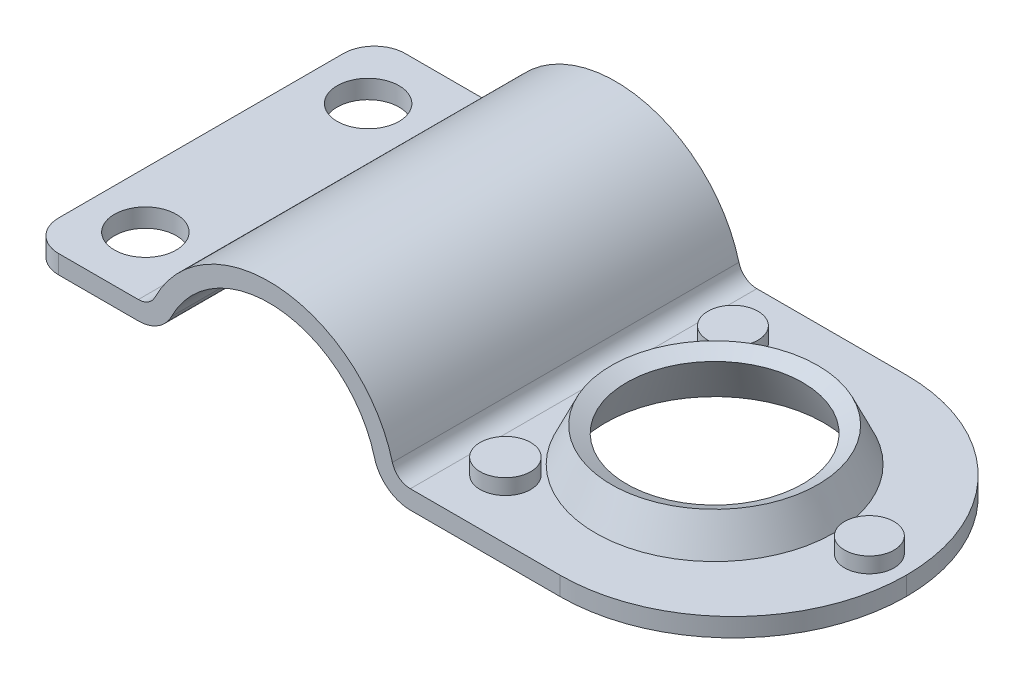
ISO-10303-21;
HEADER;
FILE_DESCRIPTION(('STEP AP214'),'2;1');
FILE_NAME('part.step','',(''),(''),'','','');
FILE_SCHEMA(('AUTOMOTIVE_DESIGN { 1 0 10303 214 1 1 1 1 }'));
ENDSEC;
DATA;
#1=APPLICATION_CONTEXT('core data for automotive mechanical design processes');
#2=APPLICATION_PROTOCOL_DEFINITION('international standard','automotive_design',2000,#1);
#3=PRODUCT_CONTEXT('',#1,'mechanical');
#4=PRODUCT('Part','Part','',(#3));
#5=PRODUCT_RELATED_PRODUCT_CATEGORY('part','',(#4));
#6=PRODUCT_DEFINITION_FORMATION('','',#4);
#7=PRODUCT_DEFINITION_CONTEXT('part definition',#1,'design');
#8=PRODUCT_DEFINITION('design','',#6,#7);
#9=PRODUCT_DEFINITION_SHAPE('','',#8);
#10=(LENGTH_UNIT() NAMED_UNIT(*) SI_UNIT(.MILLI.,.METRE.));
#11=(NAMED_UNIT(*) PLANE_ANGLE_UNIT() SI_UNIT($,.RADIAN.));
#12=(NAMED_UNIT(*) SI_UNIT($,.STERADIAN.) SOLID_ANGLE_UNIT());
#13=UNCERTAINTY_MEASURE_WITH_UNIT(LENGTH_MEASURE(1.E-05),#10,'distance_accuracy_value','');
#14=(GEOMETRIC_REPRESENTATION_CONTEXT(3) GLOBAL_UNCERTAINTY_ASSIGNED_CONTEXT((#13)) GLOBAL_UNIT_ASSIGNED_CONTEXT((#10,
#11,#12)) REPRESENTATION_CONTEXT('',''));
#15=CARTESIAN_POINT('',(0.,0.,0.));
#16=DIRECTION('',(0.,0.,1.));
#17=DIRECTION('',(1.,0.,0.));
#18=AXIS2_PLACEMENT_3D('',#15,#16,#17);
#19=CARTESIAN_POINT('',(22.8245481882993,2.99999999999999,1010.));
#20=DIRECTION('',(0.,-1.,0.));
#21=DIRECTION('',(1.,0.,0.));
#22=AXIS2_PLACEMENT_3D('',#19,#20,#21);
#23=PLANE('',#22);
#24=CARTESIAN_POINT('',(28.5730973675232,2.99999999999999,1019.61493336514));
#25=DIRECTION('',(0.,-1.,0.));
#26=DIRECTION('',(1.,0.,0.));
#27=AXIS2_PLACEMENT_3D('',#24,#25,#26);
#28=CIRCLE('',#27,4.05076971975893);
#29=CARTESIAN_POINT('',(32.6238670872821,2.99999999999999,1019.61493336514));
#30=VERTEX_POINT('',#29);
#31=EDGE_CURVE('E37',#30,#30,#28,.F.);
#32=ORIENTED_EDGE('',*,*,#31,.F.);
#33=EDGE_LOOP('',(#32));
#34=FACE_BOUND('',#33,.T.);
#35=CARTESIAN_POINT('',(44.,2.99999999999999,1038.));
#36=DIRECTION('',(0.,-1.,0.));
#37=DIRECTION('',(1.,0.,0.));
#38=AXIS2_PLACEMENT_3D('',#35,#36,#37);
#39=CIRCLE('',#38,19.25);
#40=CARTESIAN_POINT('',(63.25,2.99999999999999,1038.));
#41=VERTEX_POINT('',#40);
#42=EDGE_CURVE('E251',#41,#41,#39,.F.);
#43=ORIENTED_EDGE('',*,*,#42,.F.);
#44=EDGE_LOOP('',(#43));
#45=FACE_BOUND('',#44,.T.);
#46=DIRECTION('',(1.,0.,0.));
#47=VECTOR('',#46,1.);
#48=CARTESIAN_POINT('',(22.8245481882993,2.99999999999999,1066.));
#49=LINE('',#48,#47);
#50=CARTESIAN_POINT('',(22.8245481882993,2.99999999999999,1066.));
#51=VERTEX_POINT('',#50);
#52=CARTESIAN_POINT('',(47.,2.99999999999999,1066.));
#53=VERTEX_POINT('',#52);
#54=EDGE_CURVE('E178',#51,#53,#49,.T.);
#55=ORIENTED_EDGE('',*,*,#54,.T.);
#56=CARTESIAN_POINT('',(47.,2.99999999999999,1038.));
#57=DIRECTION('',(0.,-1.,0.));
#58=DIRECTION('',(1.,0.,0.));
#59=AXIS2_PLACEMENT_3D('',#56,#57,#58);
#60=CIRCLE('',#59,28.);
#61=CARTESIAN_POINT('',(75.,2.99999999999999,1038.));
#62=VERTEX_POINT('',#61);
#63=EDGE_CURVE('E49',#53,#62,#60,.F.);
#64=ORIENTED_EDGE('',*,*,#63,.T.);
#65=CARTESIAN_POINT('',(47.,2.99999999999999,1038.));
#66=DIRECTION('',(0.,-1.,0.));
#67=DIRECTION('',(1.,0.,0.));
#68=AXIS2_PLACEMENT_3D('',#65,#66,#67);
#69=CIRCLE('',#68,28.);
#70=CARTESIAN_POINT('',(47.,2.99999999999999,1010.));
#71=VERTEX_POINT('',#70);
#72=EDGE_CURVE('E44',#62,#71,#69,.F.);
#73=ORIENTED_EDGE('',*,*,#72,.T.);
#74=DIRECTION('',(1.,0.,0.));
#75=VECTOR('',#74,1.);
#76=CARTESIAN_POINT('',(22.8245481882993,2.99999999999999,1010.));
#77=LINE('',#76,#75);
#78=CARTESIAN_POINT('',(22.8245481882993,2.99999999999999,1010.));
#79=VERTEX_POINT('',#78);
#80=EDGE_CURVE('E198',#79,#71,#77,.T.);
#81=ORIENTED_EDGE('',*,*,#80,.F.);
#82=DIRECTION('',(0.,0.,1.));
#83=VECTOR('',#82,1.);
#84=CARTESIAN_POINT('',(22.8245481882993,2.99999999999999,1010.));
#85=LINE('',#84,#83);
#86=EDGE_CURVE('E200',#79,#51,#85,.T.);
#87=ORIENTED_EDGE('',*,*,#86,.T.);
#88=EDGE_LOOP('',(#55,#64,#73,#81,#87));
#89=FACE_BOUND('',#88,.T.);
#90=CARTESIAN_POINT('',(69.,2.99999999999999,1038.));
#91=DIRECTION('',(0.,-1.,0.));
#92=DIRECTION('',(1.,0.,0.));
#93=AXIS2_PLACEMENT_3D('',#90,#91,#92);
#94=CIRCLE('',#93,4.00000000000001);
#95=CARTESIAN_POINT('',(73.,2.99999999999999,1038.));
#96=VERTEX_POINT('',#95);
#97=EDGE_CURVE('E254',#96,#96,#94,.F.);
#98=ORIENTED_EDGE('',*,*,#97,.F.);
#99=EDGE_LOOP('',(#98));
#100=FACE_BOUND('',#99,.T.);
#101=CARTESIAN_POINT('',(28.5730973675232,2.99999999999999,1056.38506663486));
#102=DIRECTION('',(0.,-1.,0.));
#103=DIRECTION('',(1.,0.,0.));
#104=AXIS2_PLACEMENT_3D('',#101,#102,#103);
#105=CIRCLE('',#104,4.08946510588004);
#106=CARTESIAN_POINT('',(32.6625624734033,2.99999999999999,1056.38506663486));
#107=VERTEX_POINT('',#106);
#108=EDGE_CURVE('E11',#107,#107,#105,.F.);
#109=ORIENTED_EDGE('',*,*,#108,.F.);
#110=EDGE_LOOP('',(#109));
#111=FACE_BOUND('',#110,.T.);
#112=ADVANCED_FACE('F29',(#34,#45,#89,#100,#111),#23,.F.);
#113=CARTESIAN_POINT('',(22.8245481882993,0.,1010.));
#114=DIRECTION('',(0.,1.,0.));
#115=DIRECTION('',(0.,0.,1.));
#116=AXIS2_PLACEMENT_3D('',#113,#114,#115);
#117=PLANE('',#116);
#118=CARTESIAN_POINT('',(69.,0.,1038.));
#119=DIRECTION('',(0.,1.,0.));
#120=DIRECTION('',(-1.,0.,0.));
#121=AXIS2_PLACEMENT_3D('',#118,#119,#120);
#122=CIRCLE('',#121,3.00000000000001);
#123=CARTESIAN_POINT('',(66.,0.,1038.));
#124=VERTEX_POINT('',#123);
#125=EDGE_CURVE('E405',#124,#124,#122,.T.);
#126=ORIENTED_EDGE('',*,*,#125,.T.);
#127=EDGE_LOOP('',(#126));
#128=FACE_BOUND('',#127,.T.);
#129=CARTESIAN_POINT('',(28.5730973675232,0.,1019.61493336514));
#130=DIRECTION('',(0.,1.,0.));
#131=DIRECTION('',(1.,0.,0.));
#132=AXIS2_PLACEMENT_3D('',#129,#130,#131);
#133=CIRCLE('',#132,3.);
#134=CARTESIAN_POINT('',(25.5730973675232,0.,1019.61493336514));
#135=VERTEX_POINT('',#134);
#136=EDGE_CURVE('E409',#135,#135,#133,.T.);
#137=ORIENTED_EDGE('',*,*,#136,.T.);
#138=EDGE_LOOP('',(#137));
#139=FACE_BOUND('',#138,.T.);
#140=CARTESIAN_POINT('',(28.5730973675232,0.,1056.38506663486));
#141=DIRECTION('',(0.,1.,0.));
#142=DIRECTION('',(-1.,0.,0.));
#143=AXIS2_PLACEMENT_3D('',#140,#141,#142);
#144=CIRCLE('',#143,3.);
#145=CARTESIAN_POINT('',(25.5730973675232,0.,1056.38506663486));
#146=VERTEX_POINT('',#145);
#147=EDGE_CURVE('E413',#146,#146,#144,.T.);
#148=ORIENTED_EDGE('',*,*,#147,.T.);
#149=EDGE_LOOP('',(#148));
#150=FACE_BOUND('',#149,.T.);
#151=CARTESIAN_POINT('',(44.,0.,1038.));
#152=DIRECTION('',(0.,-1.,0.));
#153=DIRECTION('',(0.,0.,-1.));
#154=AXIS2_PLACEMENT_3D('',#151,#152,#153);
#155=CIRCLE('',#154,17.65);
#156=CARTESIAN_POINT('',(44.,0.,1020.35));
#157=VERTEX_POINT('',#156);
#158=EDGE_CURVE('E416',#157,#157,#155,.T.);
#159=ORIENTED_EDGE('',*,*,#158,.F.);
#160=EDGE_LOOP('',(#159));
#161=FACE_BOUND('',#160,.T.);
#162=CARTESIAN_POINT('',(47.,0.,1038.));
#163=DIRECTION('',(0.,1.,0.));
#164=DIRECTION('',(0.,0.,1.));
#165=AXIS2_PLACEMENT_3D('',#162,#163,#164);
#166=CIRCLE('',#165,28.);
#167=CARTESIAN_POINT('',(47.,0.,1010.));
#168=VERTEX_POINT('',#167);
#169=CARTESIAN_POINT('',(75.,0.,1038.));
#170=VERTEX_POINT('',#169);
#171=EDGE_CURVE('E242',#168,#170,#166,.F.);
#172=ORIENTED_EDGE('',*,*,#171,.T.);
#173=CARTESIAN_POINT('',(47.,0.,1038.));
#174=DIRECTION('',(0.,1.,0.));
#175=DIRECTION('',(0.,0.,1.));
#176=AXIS2_PLACEMENT_3D('',#173,#174,#175);
#177=CIRCLE('',#176,28.);
#178=CARTESIAN_POINT('',(47.,0.,1066.));
#179=VERTEX_POINT('',#178);
#180=EDGE_CURVE('E141',#170,#179,#177,.F.);
#181=ORIENTED_EDGE('',*,*,#180,.T.);
#182=DIRECTION('',(-1.,0.,0.));
#183=VECTOR('',#182,1.);
#184=CARTESIAN_POINT('',(22.8245481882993,0.,1066.));
#185=LINE('',#184,#183);
#186=CARTESIAN_POINT('',(22.8245481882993,0.,1066.));
#187=VERTEX_POINT('',#186);
#188=EDGE_CURVE('E135',#179,#187,#185,.T.);
#189=ORIENTED_EDGE('',*,*,#188,.T.);
#190=DIRECTION('',(0.,0.,1.));
#191=VECTOR('',#190,1.);
#192=CARTESIAN_POINT('',(22.8245481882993,0.,1010.));
#193=LINE('',#192,#191);
#194=CARTESIAN_POINT('',(22.8245481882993,0.,1010.));
#195=VERTEX_POINT('',#194);
#196=EDGE_CURVE('E138',#195,#187,#193,.T.);
#197=ORIENTED_EDGE('',*,*,#196,.F.);
#198=DIRECTION('',(-1.,0.,0.));
#199=VECTOR('',#198,1.);
#200=CARTESIAN_POINT('',(22.8245481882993,0.,1010.));
#201=LINE('',#200,#199);
#202=EDGE_CURVE('E180',#168,#195,#201,.T.);
#203=ORIENTED_EDGE('',*,*,#202,.F.);
#204=EDGE_LOOP('',(#172,#181,#189,#197,#203));
#205=FACE_BOUND('',#204,.T.);
#206=ADVANCED_FACE('F31',(#128,#139,#150,#161,#205),#117,.F.);
#207=CARTESIAN_POINT('',(22.8245481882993,6.,1010.));
#208=DIRECTION('',(0.,0.,1.));
#209=DIRECTION('',(1.,0.,0.));
#210=AXIS2_PLACEMENT_3D('',#207,#208,#209);
#211=CYLINDRICAL_SURFACE('',#210,6.);
#212=CARTESIAN_POINT('',(22.8245481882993,6.,1066.));
#213=DIRECTION('',(0.,0.,-1.));
#214=DIRECTION('',(-1.,0.,0.));
#215=AXIS2_PLACEMENT_3D('',#212,#213,#214);
#216=CIRCLE('',#215,6.);
#217=CARTESIAN_POINT('',(17.0216969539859,4.47457627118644,1066.));
#218=VERTEX_POINT('',#217);
#219=EDGE_CURVE('E146',#187,#218,#216,.T.);
#220=ORIENTED_EDGE('',*,*,#219,.T.);
#221=DIRECTION('',(0.,0.,1.));
#222=VECTOR('',#221,1.);
#223=CARTESIAN_POINT('',(17.0216969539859,4.47457627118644,1010.));
#224=LINE('',#223,#222);
#225=CARTESIAN_POINT('',(17.0216969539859,4.47457627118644,1010.));
#226=VERTEX_POINT('',#225);
#227=EDGE_CURVE('E155',#226,#218,#224,.T.);
#228=ORIENTED_EDGE('',*,*,#227,.F.);
#229=CARTESIAN_POINT('',(22.8245481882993,6.,1010.));
#230=DIRECTION('',(0.,0.,-1.));
#231=DIRECTION('',(-1.,0.,0.));
#232=AXIS2_PLACEMENT_3D('',#229,#230,#231);
#233=CIRCLE('',#232,6.);
#234=EDGE_CURVE('E153',#195,#226,#233,.T.);
#235=ORIENTED_EDGE('',*,*,#234,.F.);
#236=ORIENTED_EDGE('',*,*,#196,.T.);
#237=EDGE_LOOP('',(#220,#228,#235,#236));
#238=FACE_BOUND('',#237,.T.);
#239=ADVANCED_FACE('F150',(#238),#211,.T.);
#240=CARTESIAN_POINT('',(0.,0.,1010.));
#241=DIRECTION('',(0.,0.,1.));
#242=DIRECTION('',(1.,0.,0.));
#243=AXIS2_PLACEMENT_3D('',#240,#241,#242);
#244=CYLINDRICAL_SURFACE('',#243,17.6);
#245=CARTESIAN_POINT('',(0.,0.,1066.));
#246=DIRECTION('',(0.,0.,1.));
#247=DIRECTION('',(-1.,0.,0.));
#248=AXIS2_PLACEMENT_3D('',#245,#246,#247);
#249=CIRCLE('',#248,17.6);
#250=CARTESIAN_POINT('',(-15.762079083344,7.83050847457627,1066.));
#251=VERTEX_POINT('',#250);
#252=EDGE_CURVE('E160',#218,#251,#249,.T.);
#253=ORIENTED_EDGE('',*,*,#252,.T.);
#254=DIRECTION('',(0.,0.,1.));
#255=VECTOR('',#254,1.);
#256=CARTESIAN_POINT('',(-15.762079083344,7.83050847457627,1010.));
#257=LINE('',#256,#255);
#258=CARTESIAN_POINT('',(-15.762079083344,7.83050847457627,1010.));
#259=VERTEX_POINT('',#258);
#260=EDGE_CURVE('E221',#259,#251,#257,.T.);
#261=ORIENTED_EDGE('',*,*,#260,.F.);
#262=CARTESIAN_POINT('',(0.,0.,1010.));
#263=DIRECTION('',(0.,0.,1.));
#264=DIRECTION('',(-1.,0.,0.));
#265=AXIS2_PLACEMENT_3D('',#262,#263,#264);
#266=CIRCLE('',#265,17.6);
#267=EDGE_CURVE('E183',#226,#259,#266,.T.);
#268=ORIENTED_EDGE('',*,*,#267,.F.);
#269=ORIENTED_EDGE('',*,*,#227,.T.);
#270=EDGE_LOOP('',(#253,#261,#268,#269));
#271=FACE_BOUND('',#270,.T.);
#272=ADVANCED_FACE('F391',(#271),#244,.F.);
#273=CARTESIAN_POINT('',(-21.135515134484,10.5,1010.));
#274=DIRECTION('',(0.,0.,1.));
#275=DIRECTION('',(1.,0.,0.));
#276=AXIS2_PLACEMENT_3D('',#273,#274,#275);
#277=CYLINDRICAL_SURFACE('',#276,6.);
#278=CARTESIAN_POINT('',(-21.135515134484,10.5,1066.));
#279=DIRECTION('',(0.,0.,-1.));
#280=DIRECTION('',(-1.,0.,0.));
#281=AXIS2_PLACEMENT_3D('',#278,#279,#280);
#282=CIRCLE('',#281,6.);
#283=CARTESIAN_POINT('',(-21.135515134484,4.5,1066.));
#284=VERTEX_POINT('',#283);
#285=EDGE_CURVE('E162',#251,#284,#282,.T.);
#286=ORIENTED_EDGE('',*,*,#285,.T.);
#287=DIRECTION('',(0.,0.,1.));
#288=VECTOR('',#287,1.);
#289=CARTESIAN_POINT('',(-21.135515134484,4.5,1010.));
#290=LINE('',#289,#288);
#291=CARTESIAN_POINT('',(-21.135515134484,4.5,1010.));
#292=VERTEX_POINT('',#291);
#293=EDGE_CURVE('E218',#292,#284,#290,.T.);
#294=ORIENTED_EDGE('',*,*,#293,.F.);
#295=CARTESIAN_POINT('',(-21.135515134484,10.5,1010.));
#296=DIRECTION('',(0.,0.,-1.));
#297=DIRECTION('',(-1.,0.,0.));
#298=AXIS2_PLACEMENT_3D('',#295,#296,#297);
#299=CIRCLE('',#298,6.);
#300=EDGE_CURVE('E185',#259,#292,#299,.T.);
#301=ORIENTED_EDGE('',*,*,#300,.F.);
#302=ORIENTED_EDGE('',*,*,#260,.T.);
#303=EDGE_LOOP('',(#286,#294,#301,#302));
#304=FACE_BOUND('',#303,.T.);
#305=ADVANCED_FACE('F387',(#304),#277,.T.);
#306=CARTESIAN_POINT('',(-39.,4.5,1010.));
#307=DIRECTION('',(0.,1.,0.));
#308=DIRECTION('',(-1.,0.,0.));
#309=AXIS2_PLACEMENT_3D('',#306,#307,#308);
#310=PLANE('',#309);
#311=CARTESIAN_POINT('',(-30.,4.5,1020.));
#312=DIRECTION('',(0.,1.,0.));
#313=DIRECTION('',(-1.,0.,0.));
#314=AXIS2_PLACEMENT_3D('',#311,#312,#313);
#315=CIRCLE('',#314,5.00000000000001);
#316=CARTESIAN_POINT('',(-35.,4.5,1020.));
#317=VERTEX_POINT('',#316);
#318=EDGE_CURVE('E433',#317,#317,#315,.T.);
#319=ORIENTED_EDGE('',*,*,#318,.T.);
#320=EDGE_LOOP('',(#319));
#321=FACE_BOUND('',#320,.T.);
#322=CARTESIAN_POINT('',(-30.,4.5,1056.));
#323=DIRECTION('',(0.,1.,0.));
#324=DIRECTION('',(-1.,0.,0.));
#325=AXIS2_PLACEMENT_3D('',#322,#323,#324);
#326=CIRCLE('',#325,5.00000000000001);
#327=CARTESIAN_POINT('',(-35.,4.5,1056.));
#328=VERTEX_POINT('',#327);
#329=EDGE_CURVE('E427',#328,#328,#326,.T.);
#330=ORIENTED_EDGE('',*,*,#329,.T.);
#331=EDGE_LOOP('',(#330));
#332=FACE_BOUND('',#331,.T.);
#333=DIRECTION('',(-1.,0.,0.));
#334=VECTOR('',#333,1.);
#335=CARTESIAN_POINT('',(-39.,4.5,1066.));
#336=LINE('',#335,#334);
#337=CARTESIAN_POINT('',(-34.,4.5,1066.));
#338=VERTEX_POINT('',#337);
#339=EDGE_CURVE('E167',#284,#338,#336,.T.);
#340=ORIENTED_EDGE('',*,*,#339,.T.);
#341=CARTESIAN_POINT('',(-34.,4.5,1061.));
#342=DIRECTION('',(0.,1.,0.));
#343=DIRECTION('',(-1.,0.,0.));
#344=AXIS2_PLACEMENT_3D('',#341,#342,#343);
#345=CIRCLE('',#344,5.);
#346=CARTESIAN_POINT('',(-39.,4.5,1061.));
#347=VERTEX_POINT('',#346);
#348=EDGE_CURVE('E237',#338,#347,#345,.F.);
#349=ORIENTED_EDGE('',*,*,#348,.T.);
#350=DIRECTION('',(0.,0.,1.));
#351=VECTOR('',#350,1.);
#352=CARTESIAN_POINT('',(-39.,4.5,1010.));
#353=LINE('',#352,#351);
#354=CARTESIAN_POINT('',(-39.,4.5,1015.));
#355=VERTEX_POINT('',#354);
#356=EDGE_CURVE('E215',#355,#347,#353,.T.);
#357=ORIENTED_EDGE('',*,*,#356,.F.);
#358=CARTESIAN_POINT('',(-34.,4.5,1015.));
#359=DIRECTION('',(0.,1.,0.));
#360=DIRECTION('',(-1.,0.,0.));
#361=AXIS2_PLACEMENT_3D('',#358,#359,#360);
#362=CIRCLE('',#361,5.);
#363=CARTESIAN_POINT('',(-34.,4.5,1010.));
#364=VERTEX_POINT('',#363);
#365=EDGE_CURVE('E235',#355,#364,#362,.F.);
#366=ORIENTED_EDGE('',*,*,#365,.T.);
#367=DIRECTION('',(-1.,0.,0.));
#368=VECTOR('',#367,1.);
#369=CARTESIAN_POINT('',(-39.,4.5,1010.));
#370=LINE('',#369,#368);
#371=EDGE_CURVE('E187',#292,#364,#370,.T.);
#372=ORIENTED_EDGE('',*,*,#371,.F.);
#373=ORIENTED_EDGE('',*,*,#293,.T.);
#374=EDGE_LOOP('',(#340,#349,#357,#366,#372,#373));
#375=FACE_BOUND('',#374,.T.);
#376=ADVANCED_FACE('F383',(#321,#332,#375),#310,.F.);
#377=CARTESIAN_POINT('',(-39.,7.5,1010.));
#378=DIRECTION('',(1.,0.,0.));
#379=DIRECTION('',(0.,0.,-1.));
#380=AXIS2_PLACEMENT_3D('',#377,#378,#379);
#381=PLANE('',#380);
#382=ORIENTED_EDGE('',*,*,#356,.T.);
#383=DIRECTION('',(0.,1.,0.));
#384=VECTOR('',#383,1.);
#385=CARTESIAN_POINT('',(-39.,7.5,1061.));
#386=LINE('',#385,#384);
#387=CARTESIAN_POINT('',(-39.,7.5,1061.));
#388=VERTEX_POINT('',#387);
#389=EDGE_CURVE('E226',#347,#388,#386,.T.);
#390=ORIENTED_EDGE('',*,*,#389,.T.);
#391=DIRECTION('',(0.,0.,1.));
#392=VECTOR('',#391,1.);
#393=CARTESIAN_POINT('',(-39.,7.5,1010.));
#394=LINE('',#393,#392);
#395=CARTESIAN_POINT('',(-39.,7.5,1015.));
#396=VERTEX_POINT('',#395);
#397=EDGE_CURVE('E212',#396,#388,#394,.T.);
#398=ORIENTED_EDGE('',*,*,#397,.F.);
#399=DIRECTION('',(0.,1.,0.));
#400=VECTOR('',#399,1.);
#401=CARTESIAN_POINT('',(-39.,4.5,1015.));
#402=LINE('',#401,#400);
#403=EDGE_CURVE('E154',#396,#355,#402,.F.);
#404=ORIENTED_EDGE('',*,*,#403,.T.);
#405=EDGE_LOOP('',(#382,#390,#398,#404));
#406=FACE_BOUND('',#405,.T.);
#407=ADVANCED_FACE('F379',(#406),#381,.F.);
#408=CARTESIAN_POINT('',(-39.,7.5,1010.));
#409=DIRECTION('',(0.,-1.,0.));
#410=DIRECTION('',(1.,0.,0.));
#411=AXIS2_PLACEMENT_3D('',#408,#409,#410);
#412=PLANE('',#411);
#413=CARTESIAN_POINT('',(-30.,7.5,1020.));
#414=DIRECTION('',(0.,1.,0.));
#415=DIRECTION('',(1.,0.,0.));
#416=AXIS2_PLACEMENT_3D('',#413,#414,#415);
#417=CIRCLE('',#416,5.00000000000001);
#418=CARTESIAN_POINT('',(-25.,7.5,1020.));
#419=VERTEX_POINT('',#418);
#420=EDGE_CURVE('E436',#419,#419,#417,.T.);
#421=ORIENTED_EDGE('',*,*,#420,.F.);
#422=EDGE_LOOP('',(#421));
#423=FACE_BOUND('',#422,.T.);
#424=CARTESIAN_POINT('',(-30.,7.5,1056.));
#425=DIRECTION('',(0.,1.,0.));
#426=DIRECTION('',(-1.,0.,0.));
#427=AXIS2_PLACEMENT_3D('',#424,#425,#426);
#428=CIRCLE('',#427,5.00000000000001);
#429=CARTESIAN_POINT('',(-35.,7.5,1056.));
#430=VERTEX_POINT('',#429);
#431=EDGE_CURVE('E430',#430,#430,#428,.T.);
#432=ORIENTED_EDGE('',*,*,#431,.F.);
#433=EDGE_LOOP('',(#432));
#434=FACE_BOUND('',#433,.T.);
#435=ORIENTED_EDGE('',*,*,#397,.T.);
#436=CARTESIAN_POINT('',(-34.,7.5,1061.));
#437=DIRECTION('',(0.,-1.,0.));
#438=DIRECTION('',(1.,0.,0.));
#439=AXIS2_PLACEMENT_3D('',#436,#437,#438);
#440=CIRCLE('',#439,5.);
#441=CARTESIAN_POINT('',(-34.,7.5,1066.));
#442=VERTEX_POINT('',#441);
#443=EDGE_CURVE('E231',#388,#442,#440,.F.);
#444=ORIENTED_EDGE('',*,*,#443,.T.);
#445=DIRECTION('',(1.,0.,0.));
#446=VECTOR('',#445,1.);
#447=CARTESIAN_POINT('',(-39.,7.5,1066.));
#448=LINE('',#447,#446);
#449=CARTESIAN_POINT('',(-21.135515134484,7.5,1066.));
#450=VERTEX_POINT('',#449);
#451=EDGE_CURVE('E170',#442,#450,#448,.T.);
#452=ORIENTED_EDGE('',*,*,#451,.T.);
#453=DIRECTION('',(0.,0.,1.));
#454=VECTOR('',#453,1.);
#455=CARTESIAN_POINT('',(-21.135515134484,7.5,1010.));
#456=LINE('',#455,#454);
#457=CARTESIAN_POINT('',(-21.135515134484,7.5,1010.));
#458=VERTEX_POINT('',#457);
#459=EDGE_CURVE('E209',#458,#450,#456,.T.);
#460=ORIENTED_EDGE('',*,*,#459,.F.);
#461=DIRECTION('',(1.,0.,0.));
#462=VECTOR('',#461,1.);
#463=CARTESIAN_POINT('',(-39.,7.5,1010.));
#464=LINE('',#463,#462);
#465=CARTESIAN_POINT('',(-34.,7.5,1010.));
#466=VERTEX_POINT('',#465);
#467=EDGE_CURVE('E190',#466,#458,#464,.T.);
#468=ORIENTED_EDGE('',*,*,#467,.F.);
#469=CARTESIAN_POINT('',(-34.,7.5,1015.));
#470=DIRECTION('',(0.,-1.,0.));
#471=DIRECTION('',(1.,0.,0.));
#472=AXIS2_PLACEMENT_3D('',#469,#470,#471);
#473=CIRCLE('',#472,5.);
#474=EDGE_CURVE('E229',#466,#396,#473,.F.);
#475=ORIENTED_EDGE('',*,*,#474,.T.);
#476=EDGE_LOOP('',(#435,#444,#452,#460,#468,#475));
#477=FACE_BOUND('',#476,.T.);
#478=ADVANCED_FACE('F375',(#423,#434,#477),#412,.F.);
#479=CARTESIAN_POINT('',(-21.135515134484,10.5,1010.));
#480=DIRECTION('',(0.,0.,1.));
#481=DIRECTION('',(1.,0.,0.));
#482=AXIS2_PLACEMENT_3D('',#479,#480,#481);
#483=CYLINDRICAL_SURFACE('',#482,3.);
#484=CARTESIAN_POINT('',(-21.135515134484,10.5,1066.));
#485=DIRECTION('',(0.,0.,1.));
#486=DIRECTION('',(-1.,0.,0.));
#487=AXIS2_PLACEMENT_3D('',#484,#485,#486);
#488=CIRCLE('',#487,3.);
#489=CARTESIAN_POINT('',(-18.448797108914,9.16525423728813,1066.));
#490=VERTEX_POINT('',#489);
#491=EDGE_CURVE('E172',#450,#490,#488,.T.);
#492=ORIENTED_EDGE('',*,*,#491,.T.);
#493=DIRECTION('',(0.,0.,1.));
#494=VECTOR('',#493,1.);
#495=CARTESIAN_POINT('',(-18.448797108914,9.16525423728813,1010.));
#496=LINE('',#495,#494);
#497=CARTESIAN_POINT('',(-18.448797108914,9.16525423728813,1010.));
#498=VERTEX_POINT('',#497);
#499=EDGE_CURVE('E206',#498,#490,#496,.T.);
#500=ORIENTED_EDGE('',*,*,#499,.F.);
#501=CARTESIAN_POINT('',(-21.135515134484,10.5,1010.));
#502=DIRECTION('',(0.,0.,1.));
#503=DIRECTION('',(-1.,0.,0.));
#504=AXIS2_PLACEMENT_3D('',#501,#502,#503);
#505=CIRCLE('',#504,3.);
#506=EDGE_CURVE('E192',#458,#498,#505,.T.);
#507=ORIENTED_EDGE('',*,*,#506,.F.);
#508=ORIENTED_EDGE('',*,*,#459,.T.);
#509=EDGE_LOOP('',(#492,#500,#507,#508));
#510=FACE_BOUND('',#509,.T.);
#511=ADVANCED_FACE('F371',(#510),#483,.F.);
#512=CARTESIAN_POINT('',(0.,0.,1010.));
#513=DIRECTION('',(0.,0.,1.));
#514=DIRECTION('',(1.,0.,0.));
#515=AXIS2_PLACEMENT_3D('',#512,#513,#514);
#516=CYLINDRICAL_SURFACE('',#515,20.6);
#517=CARTESIAN_POINT('',(0.,0.,1066.));
#518=DIRECTION('',(0.,0.,-1.));
#519=DIRECTION('',(-1.,0.,0.));
#520=AXIS2_PLACEMENT_3D('',#517,#518,#519);
#521=CIRCLE('',#520,20.6);
#522=CARTESIAN_POINT('',(19.9231225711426,5.23728813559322,1066.));
#523=VERTEX_POINT('',#522);
#524=EDGE_CURVE('E174',#490,#523,#521,.T.);
#525=ORIENTED_EDGE('',*,*,#524,.T.);
#526=DIRECTION('',(0.,0.,1.));
#527=VECTOR('',#526,1.);
#528=CARTESIAN_POINT('',(19.9231225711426,5.23728813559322,1010.));
#529=LINE('',#528,#527);
#530=CARTESIAN_POINT('',(19.9231225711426,5.23728813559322,1010.));
#531=VERTEX_POINT('',#530);
#532=EDGE_CURVE('E203',#531,#523,#529,.T.);
#533=ORIENTED_EDGE('',*,*,#532,.F.);
#534=CARTESIAN_POINT('',(0.,0.,1010.));
#535=DIRECTION('',(0.,0.,-1.));
#536=DIRECTION('',(-1.,0.,0.));
#537=AXIS2_PLACEMENT_3D('',#534,#535,#536);
#538=CIRCLE('',#537,20.6);
#539=EDGE_CURVE('E194',#498,#531,#538,.T.);
#540=ORIENTED_EDGE('',*,*,#539,.F.);
#541=ORIENTED_EDGE('',*,*,#499,.T.);
#542=EDGE_LOOP('',(#525,#533,#540,#541));
#543=FACE_BOUND('',#542,.T.);
#544=ADVANCED_FACE('F367',(#543),#516,.T.);
#545=CARTESIAN_POINT('',(22.8245481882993,5.99999999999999,1010.));
#546=DIRECTION('',(0.,0.,1.));
#547=DIRECTION('',(1.,0.,0.));
#548=AXIS2_PLACEMENT_3D('',#545,#546,#547);
#549=CYLINDRICAL_SURFACE('',#548,3.);
#550=CARTESIAN_POINT('',(22.8245481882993,5.99999999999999,1066.));
#551=DIRECTION('',(0.,0.,1.));
#552=DIRECTION('',(-1.,0.,0.));
#553=AXIS2_PLACEMENT_3D('',#550,#551,#552);
#554=CIRCLE('',#553,3.);
#555=EDGE_CURVE('E176',#523,#51,#554,.T.);
#556=ORIENTED_EDGE('',*,*,#555,.T.);
#557=ORIENTED_EDGE('',*,*,#86,.F.);
#558=CARTESIAN_POINT('',(22.8245481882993,5.99999999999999,1010.));
#559=DIRECTION('',(0.,0.,1.));
#560=DIRECTION('',(-1.,0.,0.));
#561=AXIS2_PLACEMENT_3D('',#558,#559,#560);
#562=CIRCLE('',#561,3.);
#563=EDGE_CURVE('E196',#531,#79,#562,.T.);
#564=ORIENTED_EDGE('',*,*,#563,.F.);
#565=ORIENTED_EDGE('',*,*,#532,.T.);
#566=EDGE_LOOP('',(#556,#557,#564,#565));
#567=FACE_BOUND('',#566,.T.);
#568=ADVANCED_FACE('F362',(#567),#549,.F.);
#569=CARTESIAN_POINT('',(22.8245481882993,6.,1010.));
#570=DIRECTION('',(0.,0.,-1.));
#571=DIRECTION('',(-1.,0.,0.));
#572=AXIS2_PLACEMENT_3D('',#569,#570,#571);
#573=PLANE('',#572);
#574=ORIENTED_EDGE('',*,*,#80,.T.);
#575=DIRECTION('',(0.,-1.,0.));
#576=VECTOR('',#575,1.);
#577=CARTESIAN_POINT('',(47.,0.,1010.));
#578=LINE('',#577,#576);
#579=EDGE_CURVE('E249',#71,#168,#578,.T.);
#580=ORIENTED_EDGE('',*,*,#579,.T.);
#581=ORIENTED_EDGE('',*,*,#202,.T.);
#582=ORIENTED_EDGE('',*,*,#234,.T.);
#583=ORIENTED_EDGE('',*,*,#267,.T.);
#584=ORIENTED_EDGE('',*,*,#300,.T.);
#585=ORIENTED_EDGE('',*,*,#371,.T.);
#586=DIRECTION('',(0.,1.,0.));
#587=VECTOR('',#586,1.);
#588=CARTESIAN_POINT('',(-34.,7.5,1010.));
#589=LINE('',#588,#587);
#590=EDGE_CURVE('E239',#364,#466,#589,.T.);
#591=ORIENTED_EDGE('',*,*,#590,.T.);
#592=ORIENTED_EDGE('',*,*,#467,.T.);
#593=ORIENTED_EDGE('',*,*,#506,.T.);
#594=ORIENTED_EDGE('',*,*,#539,.T.);
#595=ORIENTED_EDGE('',*,*,#563,.T.);
#596=EDGE_LOOP('',(#574,#580,#581,#582,#583,#584,#585,#591,#592,#593,#594,#595));
#597=FACE_BOUND('',#596,.T.);
#598=ADVANCED_FACE('F360',(#597),#573,.T.);
#599=CARTESIAN_POINT('',(22.8245481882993,6.,1066.));
#600=DIRECTION('',(0.,0.,-1.));
#601=DIRECTION('',(-1.,0.,0.));
#602=AXIS2_PLACEMENT_3D('',#599,#600,#601);
#603=PLANE('',#602);
#604=ORIENTED_EDGE('',*,*,#188,.F.);
#605=DIRECTION('',(0.,-1.,0.));
#606=VECTOR('',#605,1.);
#607=CARTESIAN_POINT('',(47.,6.,1066.));
#608=LINE('',#607,#606);
#609=EDGE_CURVE('E245',#179,#53,#608,.F.);
#610=ORIENTED_EDGE('',*,*,#609,.T.);
#611=ORIENTED_EDGE('',*,*,#54,.F.);
#612=ORIENTED_EDGE('',*,*,#555,.F.);
#613=ORIENTED_EDGE('',*,*,#524,.F.);
#614=ORIENTED_EDGE('',*,*,#491,.F.);
#615=ORIENTED_EDGE('',*,*,#451,.F.);
#616=DIRECTION('',(0.,1.,0.));
#617=VECTOR('',#616,1.);
#618=CARTESIAN_POINT('',(-34.,6.,1066.));
#619=LINE('',#618,#617);
#620=EDGE_CURVE('E233',#442,#338,#619,.F.);
#621=ORIENTED_EDGE('',*,*,#620,.T.);
#622=ORIENTED_EDGE('',*,*,#339,.F.);
#623=ORIENTED_EDGE('',*,*,#285,.F.);
#624=ORIENTED_EDGE('',*,*,#252,.F.);
#625=ORIENTED_EDGE('',*,*,#219,.F.);
#626=EDGE_LOOP('',(#604,#610,#611,#612,#613,#614,#615,#621,#622,#623,#624,#625));
#627=FACE_BOUND('',#626,.T.);
#628=ADVANCED_FACE('F158',(#627),#603,.F.);
#629=CARTESIAN_POINT('',(-34.,7.5,1061.));
#630=DIRECTION('',(0.,1.,0.));
#631=DIRECTION('',(0.,0.,1.));
#632=AXIS2_PLACEMENT_3D('',#629,#630,#631);
#633=CYLINDRICAL_SURFACE('',#632,5.);
#634=ORIENTED_EDGE('',*,*,#348,.F.);
#635=ORIENTED_EDGE('',*,*,#620,.F.);
#636=ORIENTED_EDGE('',*,*,#443,.F.);
#637=ORIENTED_EDGE('',*,*,#389,.F.);
#638=EDGE_LOOP('',(#634,#635,#636,#637));
#639=FACE_BOUND('',#638,.T.);
#640=ADVANCED_FACE('F353',(#639),#633,.T.);
#641=CARTESIAN_POINT('',(-34.,6.,1015.));
#642=DIRECTION('',(0.,-1.,0.));
#643=DIRECTION('',(0.,0.,-1.));
#644=AXIS2_PLACEMENT_3D('',#641,#642,#643);
#645=CYLINDRICAL_SURFACE('',#644,5.);
#646=ORIENTED_EDGE('',*,*,#365,.F.);
#647=ORIENTED_EDGE('',*,*,#403,.F.);
#648=ORIENTED_EDGE('',*,*,#474,.F.);
#649=ORIENTED_EDGE('',*,*,#590,.F.);
#650=EDGE_LOOP('',(#646,#647,#648,#649));
#651=FACE_BOUND('',#650,.T.);
#652=ADVANCED_FACE('F349',(#651),#645,.T.);
#653=CARTESIAN_POINT('',(47.,6.,1038.));
#654=DIRECTION('',(0.,1.,0.));
#655=DIRECTION('',(0.,0.,1.));
#656=AXIS2_PLACEMENT_3D('',#653,#654,#655);
#657=CYLINDRICAL_SURFACE('',#656,28.);
#658=ORIENTED_EDGE('',*,*,#579,.F.);
#659=ORIENTED_EDGE('',*,*,#72,.F.);
#660=DIRECTION('',(0.,-1.,0.));
#661=VECTOR('',#660,1.);
#662=CARTESIAN_POINT('',(75.,2.99999999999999,1038.));
#663=LINE('',#662,#661);
#664=EDGE_CURVE('E147',#170,#62,#663,.F.);
#665=ORIENTED_EDGE('',*,*,#664,.F.);
#666=ORIENTED_EDGE('',*,*,#171,.F.);
#667=EDGE_LOOP('',(#658,#659,#665,#666));
#668=FACE_BOUND('',#667,.T.);
#669=ADVANCED_FACE('F345',(#668),#657,.T.);
#670=CARTESIAN_POINT('',(47.,2.99999999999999,1038.));
#671=DIRECTION('',(0.,-1.,0.));
#672=DIRECTION('',(0.,0.,-1.));
#673=AXIS2_PLACEMENT_3D('',#670,#671,#672);
#674=CYLINDRICAL_SURFACE('',#673,28.);
#675=ORIENTED_EDGE('',*,*,#63,.F.);
#676=ORIENTED_EDGE('',*,*,#609,.F.);
#677=ORIENTED_EDGE('',*,*,#180,.F.);
#678=ORIENTED_EDGE('',*,*,#664,.T.);
#679=EDGE_LOOP('',(#675,#676,#677,#678));
#680=FACE_BOUND('',#679,.T.);
#681=ADVANCED_FACE('F341',(#680),#674,.T.);
#682=CARTESIAN_POINT('',(44.,2.99999999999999,1038.));
#683=DIRECTION('',(0.,-1.,0.));
#684=DIRECTION('',(-1.,0.,0.));
#685=AXIS2_PLACEMENT_3D('',#682,#683,#684);
#686=CONICAL_SURFACE('',#685,19.25,0.436332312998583);
#687=CARTESIAN_POINT('',(44.,8.49999999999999,1038.));
#688=DIRECTION('',(0.,-1.,0.));
#689=DIRECTION('',(0.,0.,-1.));
#690=AXIS2_PLACEMENT_3D('',#687,#688,#689);
#691=CIRCLE('',#690,16.6853078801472);
#692=CARTESIAN_POINT('',(44.,8.49999999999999,1021.31469211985));
#693=VERTEX_POINT('',#692);
#694=EDGE_CURVE('E422',#693,#693,#691,.T.);
#695=ORIENTED_EDGE('',*,*,#694,.T.);
#696=EDGE_LOOP('',(#695));
#697=FACE_BOUND('',#696,.T.);
#698=ORIENTED_EDGE('',*,*,#42,.T.);
#699=EDGE_LOOP('',(#698));
#700=FACE_BOUND('',#699,.T.);
#701=ADVANCED_FACE('F337',(#697,#700),#686,.T.);
#702=CARTESIAN_POINT('',(44.,0.,1038.));
#703=DIRECTION('',(0.,-1.,0.));
#704=DIRECTION('',(0.,0.,-1.));
#705=AXIS2_PLACEMENT_3D('',#702,#703,#704);
#706=CONICAL_SURFACE('',#705,17.65,0.436332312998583);
#707=CARTESIAN_POINT('',(44.,7.35134586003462,1038.));
#708=DIRECTION('',(0.,-1.,0.));
#709=DIRECTION('',(0.,0.,-1.));
#710=AXIS2_PLACEMENT_3D('',#707,#708,#709);
#711=CIRCLE('',#710,14.2220111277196);
#712=CARTESIAN_POINT('',(44.,7.35134586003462,1023.77798887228));
#713=VERTEX_POINT('',#712);
#714=EDGE_CURVE('E418',#713,#713,#711,.T.);
#715=ORIENTED_EDGE('',*,*,#714,.F.);
#716=EDGE_LOOP('',(#715));
#717=FACE_BOUND('',#716,.T.);
#718=ORIENTED_EDGE('',*,*,#158,.T.);
#719=EDGE_LOOP('',(#718));
#720=FACE_BOUND('',#719,.T.);
#721=ADVANCED_FACE('F333',(#717,#720),#706,.F.);
#722=CARTESIAN_POINT('',(44.,7.35134586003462,1038.));
#723=DIRECTION('',(0.,1.,0.));
#724=DIRECTION('',(0.,0.,1.));
#725=AXIS2_PLACEMENT_3D('',#722,#723,#724);
#726=CONICAL_SURFACE('',#725,14.2220111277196,1.1344640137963);
#727=ORIENTED_EDGE('',*,*,#694,.F.);
#728=EDGE_LOOP('',(#727));
#729=FACE_BOUND('',#728,.T.);
#730=ORIENTED_EDGE('',*,*,#714,.T.);
#731=EDGE_LOOP('',(#730));
#732=FACE_BOUND('',#731,.T.);
#733=ADVANCED_FACE('F329',(#729,#732),#726,.F.);
#734=CARTESIAN_POINT('',(-30.,0.,1056.));
#735=DIRECTION('',(0.,1.,0.));
#736=DIRECTION('',(-1.,0.,0.));
#737=AXIS2_PLACEMENT_3D('',#734,#735,#736);
#738=CYLINDRICAL_SURFACE('',#737,5.00000000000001);
#739=ORIENTED_EDGE('',*,*,#431,.T.);
#740=EDGE_LOOP('',(#739));
#741=FACE_BOUND('',#740,.T.);
#742=ORIENTED_EDGE('',*,*,#329,.F.);
#743=EDGE_LOOP('',(#742));
#744=FACE_BOUND('',#743,.T.);
#745=ADVANCED_FACE('F325',(#741,#744),#738,.F.);
#746=CARTESIAN_POINT('',(-30.,0.,1020.));
#747=DIRECTION('',(0.,1.,0.));
#748=DIRECTION('',(-1.,0.,0.));
#749=AXIS2_PLACEMENT_3D('',#746,#747,#748);
#750=CYLINDRICAL_SURFACE('',#749,5.00000000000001);
#751=ORIENTED_EDGE('',*,*,#420,.T.);
#752=EDGE_LOOP('',(#751));
#753=FACE_BOUND('',#752,.T.);
#754=ORIENTED_EDGE('',*,*,#318,.F.);
#755=EDGE_LOOP('',(#754));
#756=FACE_BOUND('',#755,.T.);
#757=ADVANCED_FACE('F321',(#753,#756),#750,.F.);
#758=CARTESIAN_POINT('',(28.5730973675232,0.,1056.38506663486));
#759=DIRECTION('',(0.,1.,0.));
#760=DIRECTION('',(-1.,0.,0.));
#761=AXIS2_PLACEMENT_3D('',#758,#759,#760);
#762=CYLINDRICAL_SURFACE('',#761,3.);
#763=CARTESIAN_POINT('',(28.5730973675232,2.99999999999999,1056.38506663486));
#764=DIRECTION('',(0.,1.,0.));
#765=DIRECTION('',(-1.,0.,0.));
#766=AXIS2_PLACEMENT_3D('',#763,#764,#765);
#767=CIRCLE('',#766,3.);
#768=CARTESIAN_POINT('',(25.5730973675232,2.99999999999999,1056.38506663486));
#769=VERTEX_POINT('',#768);
#770=EDGE_CURVE('E454',#769,#769,#767,.F.);
#771=CARTESIAN_POINT('',(25.5730973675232,0.,1056.38506663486));
#772=CARTESIAN_POINT('',(25.5730973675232,0.0312499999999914,1056.38506663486));
#773=CARTESIAN_POINT('',(25.5730973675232,0.0624999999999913,1056.38506663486));
#774=CARTESIAN_POINT('',(25.5730973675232,0.124999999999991,1056.38506663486));
#775=CARTESIAN_POINT('',(25.5730973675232,0.156249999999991,1056.38506663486));
#776=CARTESIAN_POINT('',(25.5730973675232,0.218749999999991,1056.38506663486));
#777=CARTESIAN_POINT('',(25.5730973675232,0.249999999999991,1056.38506663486));
#778=CARTESIAN_POINT('',(25.5730973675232,0.312499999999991,1056.38506663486));
#779=CARTESIAN_POINT('',(25.5730973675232,0.343749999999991,1056.38506663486));
#780=CARTESIAN_POINT('',(25.5730973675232,0.406249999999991,1056.38506663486));
#781=CARTESIAN_POINT('',(25.5730973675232,0.437499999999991,1056.38506663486));
#782=CARTESIAN_POINT('',(25.5730973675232,0.499999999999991,1056.38506663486));
#783=CARTESIAN_POINT('',(25.5730973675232,0.531249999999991,1056.38506663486));
#784=CARTESIAN_POINT('',(25.5730973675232,0.593749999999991,1056.38506663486));
#785=CARTESIAN_POINT('',(25.5730973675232,0.624999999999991,1056.38506663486));
#786=CARTESIAN_POINT('',(25.5730973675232,0.687499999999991,1056.38506663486));
#787=CARTESIAN_POINT('',(25.5730973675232,0.718749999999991,1056.38506663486));
#788=CARTESIAN_POINT('',(25.5730973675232,0.781249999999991,1056.38506663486));
#789=CARTESIAN_POINT('',(25.5730973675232,0.812499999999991,1056.38506663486));
#790=CARTESIAN_POINT('',(25.5730973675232,0.874999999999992,1056.38506663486));
#791=CARTESIAN_POINT('',(25.5730973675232,0.906249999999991,1056.38506663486));
#792=CARTESIAN_POINT('',(25.5730973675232,0.968749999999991,1056.38506663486));
#793=CARTESIAN_POINT('',(25.5730973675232,0.999999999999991,1056.38506663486));
#794=CARTESIAN_POINT('',(25.5730973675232,1.06249999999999,1056.38506663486));
#795=CARTESIAN_POINT('',(25.5730973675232,1.09374999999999,1056.38506663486));
#796=CARTESIAN_POINT('',(25.5730973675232,1.15624999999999,1056.38506663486));
#797=CARTESIAN_POINT('',(25.5730973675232,1.18749999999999,1056.38506663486));
#798=CARTESIAN_POINT('',(25.5730973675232,1.24999999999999,1056.38506663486));
#799=CARTESIAN_POINT('',(25.5730973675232,1.28124999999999,1056.38506663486));
#800=CARTESIAN_POINT('',(25.5730973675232,1.34374999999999,1056.38506663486));
#801=CARTESIAN_POINT('',(25.5730973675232,1.37499999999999,1056.38506663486));
#802=CARTESIAN_POINT('',(25.5730973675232,1.43749999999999,1056.38506663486));
#803=CARTESIAN_POINT('',(25.5730973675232,1.46874999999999,1056.38506663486));
#804=CARTESIAN_POINT('',(25.5730973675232,1.53124999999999,1056.38506663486));
#805=CARTESIAN_POINT('',(25.5730973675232,1.56249999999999,1056.38506663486));
#806=CARTESIAN_POINT('',(25.5730973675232,1.62499999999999,1056.38506663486));
#807=CARTESIAN_POINT('',(25.5730973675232,1.65624999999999,1056.38506663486));
#808=CARTESIAN_POINT('',(25.5730973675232,1.71874999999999,1056.38506663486));
#809=CARTESIAN_POINT('',(25.5730973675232,1.74999999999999,1056.38506663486));
#810=CARTESIAN_POINT('',(25.5730973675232,1.81249999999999,1056.38506663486));
#811=CARTESIAN_POINT('',(25.5730973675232,1.84374999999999,1056.38506663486));
#812=CARTESIAN_POINT('',(25.5730973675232,1.90624999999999,1056.38506663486));
#813=CARTESIAN_POINT('',(25.5730973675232,1.93749999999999,1056.38506663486));
#814=CARTESIAN_POINT('',(25.5730973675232,1.99999999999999,1056.38506663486));
#815=CARTESIAN_POINT('',(25.5730973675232,2.03124999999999,1056.38506663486));
#816=CARTESIAN_POINT('',(25.5730973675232,2.09374999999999,1056.38506663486));
#817=CARTESIAN_POINT('',(25.5730973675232,2.12499999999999,1056.38506663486));
#818=CARTESIAN_POINT('',(25.5730973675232,2.18749999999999,1056.38506663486));
#819=CARTESIAN_POINT('',(25.5730973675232,2.21874999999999,1056.38506663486));
#820=CARTESIAN_POINT('',(25.5730973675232,2.28124999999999,1056.38506663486));
#821=CARTESIAN_POINT('',(25.5730973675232,2.31249999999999,1056.38506663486));
#822=CARTESIAN_POINT('',(25.5730973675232,2.37499999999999,1056.38506663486));
#823=CARTESIAN_POINT('',(25.5730973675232,2.40624999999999,1056.38506663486));
#824=CARTESIAN_POINT('',(25.5730973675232,2.46874999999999,1056.38506663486));
#825=CARTESIAN_POINT('',(25.5730973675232,2.49999999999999,1056.38506663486));
#826=CARTESIAN_POINT('',(25.5730973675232,2.56249999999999,1056.38506663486));
#827=CARTESIAN_POINT('',(25.5730973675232,2.59374999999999,1056.38506663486));
#828=CARTESIAN_POINT('',(25.5730973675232,2.65624999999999,1056.38506663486));
#829=CARTESIAN_POINT('',(25.5730973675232,2.68749999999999,1056.38506663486));
#830=CARTESIAN_POINT('',(25.5730973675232,2.74999999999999,1056.38506663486));
#831=CARTESIAN_POINT('',(25.5730973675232,2.78124999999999,1056.38506663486));
#832=CARTESIAN_POINT('',(25.5730973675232,2.84374999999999,1056.38506663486));
#833=CARTESIAN_POINT('',(25.5730973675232,2.87499999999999,1056.38506663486));
#834=CARTESIAN_POINT('',(25.5730973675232,2.93749999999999,1056.38506663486));
#835=CARTESIAN_POINT('',(25.5730973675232,2.96874999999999,1056.38506663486));
#836=CARTESIAN_POINT('',(25.5730973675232,2.99999999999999,1056.38506663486));
#837=B_SPLINE_CURVE_WITH_KNOTS('',3,(#771,#772,#773,#774,#775,#776,#777,#778,#779,#780,#781,
#782,#783,#784,#785,#786,#787,#788,#789,#790,#791,#792,#793,#794,#795,#796,#797,#798,#799,#800,
#801,#802,#803,#804,#805,#806,#807,#808,#809,#810,#811,#812,#813,#814,#815,#816,#817,#818,#819,
#820,#821,#822,#823,#824,#825,#826,#827,#828,#829,#830,#831,#832,#833,#834,#835,#836),
.UNSPECIFIED.,.F.,.F.,(4,2,2,2,2,2,2,2,2,2,2,2,2,2,2,2,2,2,2,2,2,2,2,2,2,2,2,2,2,2,2,2,4),(0.,
0.09375,0.1875,0.28125,0.375,0.46875,0.5625,0.65625,0.75,0.84375,0.9375,1.03125,1.125,1.21875,
1.3125,1.40625,1.5,1.59375,1.6875,1.78125,1.875,1.96875,2.0625,2.15625,2.25,2.34375,2.4375,
2.53125,2.625,2.71875,2.8125,2.90625,3.),.UNSPECIFIED.);
#838=EDGE_CURVE('BSEAM317',#146,#769,#837,.T.);
#839=ORIENTED_EDGE('',*,*,#147,.F.);
#840=ORIENTED_EDGE('',*,*,#770,.F.);
#841=ORIENTED_EDGE('',*,*,#838,.T.);
#842=ORIENTED_EDGE('',*,*,#838,.F.);
#843=EDGE_LOOP('',(#839,#841,#840,#842));
#844=FACE_BOUND('',#843,.T.);
#845=ADVANCED_FACE('F317',(#844),#762,.F.);
#846=CARTESIAN_POINT('',(28.5730973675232,0.,1019.61493336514));
#847=DIRECTION('',(0.,1.,0.));
#848=DIRECTION('',(-1.,0.,0.));
#849=AXIS2_PLACEMENT_3D('',#846,#847,#848);
#850=CYLINDRICAL_SURFACE('',#849,3.);
#851=CARTESIAN_POINT('',(28.5730973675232,2.99999999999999,1019.61493336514));
#852=DIRECTION('',(0.,1.,0.));
#853=DIRECTION('',(-1.,0.,0.));
#854=AXIS2_PLACEMENT_3D('',#851,#852,#853);
#855=CIRCLE('',#854,3.);
#856=CARTESIAN_POINT('',(25.5730973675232,2.99999999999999,1019.61493336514));
#857=VERTEX_POINT('',#856);
#858=EDGE_CURVE('E448',#857,#857,#855,.F.);
#859=CARTESIAN_POINT('',(25.5730973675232,0.,1019.61493336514));
#860=CARTESIAN_POINT('',(25.5730973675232,0.0312499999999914,1019.61493336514));
#861=CARTESIAN_POINT('',(25.5730973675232,0.0624999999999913,1019.61493336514));
#862=CARTESIAN_POINT('',(25.5730973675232,0.124999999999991,1019.61493336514));
#863=CARTESIAN_POINT('',(25.5730973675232,0.156249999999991,1019.61493336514));
#864=CARTESIAN_POINT('',(25.5730973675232,0.218749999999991,1019.61493336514));
#865=CARTESIAN_POINT('',(25.5730973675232,0.249999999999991,1019.61493336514));
#866=CARTESIAN_POINT('',(25.5730973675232,0.312499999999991,1019.61493336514));
#867=CARTESIAN_POINT('',(25.5730973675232,0.343749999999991,1019.61493336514));
#868=CARTESIAN_POINT('',(25.5730973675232,0.406249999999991,1019.61493336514));
#869=CARTESIAN_POINT('',(25.5730973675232,0.437499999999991,1019.61493336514));
#870=CARTESIAN_POINT('',(25.5730973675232,0.499999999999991,1019.61493336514));
#871=CARTESIAN_POINT('',(25.5730973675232,0.531249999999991,1019.61493336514));
#872=CARTESIAN_POINT('',(25.5730973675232,0.593749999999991,1019.61493336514));
#873=CARTESIAN_POINT('',(25.5730973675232,0.624999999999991,1019.61493336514));
#874=CARTESIAN_POINT('',(25.5730973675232,0.687499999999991,1019.61493336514));
#875=CARTESIAN_POINT('',(25.5730973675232,0.718749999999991,1019.61493336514));
#876=CARTESIAN_POINT('',(25.5730973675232,0.781249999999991,1019.61493336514));
#877=CARTESIAN_POINT('',(25.5730973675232,0.812499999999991,1019.61493336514));
#878=CARTESIAN_POINT('',(25.5730973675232,0.874999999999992,1019.61493336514));
#879=CARTESIAN_POINT('',(25.5730973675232,0.906249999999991,1019.61493336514));
#880=CARTESIAN_POINT('',(25.5730973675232,0.968749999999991,1019.61493336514));
#881=CARTESIAN_POINT('',(25.5730973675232,0.999999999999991,1019.61493336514));
#882=CARTESIAN_POINT('',(25.5730973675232,1.06249999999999,1019.61493336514));
#883=CARTESIAN_POINT('',(25.5730973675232,1.09374999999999,1019.61493336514));
#884=CARTESIAN_POINT('',(25.5730973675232,1.15624999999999,1019.61493336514));
#885=CARTESIAN_POINT('',(25.5730973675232,1.18749999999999,1019.61493336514));
#886=CARTESIAN_POINT('',(25.5730973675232,1.24999999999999,1019.61493336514));
#887=CARTESIAN_POINT('',(25.5730973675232,1.28124999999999,1019.61493336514));
#888=CARTESIAN_POINT('',(25.5730973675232,1.34374999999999,1019.61493336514));
#889=CARTESIAN_POINT('',(25.5730973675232,1.37499999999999,1019.61493336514));
#890=CARTESIAN_POINT('',(25.5730973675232,1.43749999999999,1019.61493336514));
#891=CARTESIAN_POINT('',(25.5730973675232,1.46874999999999,1019.61493336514));
#892=CARTESIAN_POINT('',(25.5730973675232,1.53124999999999,1019.61493336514));
#893=CARTESIAN_POINT('',(25.5730973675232,1.56249999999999,1019.61493336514));
#894=CARTESIAN_POINT('',(25.5730973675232,1.62499999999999,1019.61493336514));
#895=CARTESIAN_POINT('',(25.5730973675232,1.65624999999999,1019.61493336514));
#896=CARTESIAN_POINT('',(25.5730973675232,1.71874999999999,1019.61493336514));
#897=CARTESIAN_POINT('',(25.5730973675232,1.74999999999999,1019.61493336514));
#898=CARTESIAN_POINT('',(25.5730973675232,1.81249999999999,1019.61493336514));
#899=CARTESIAN_POINT('',(25.5730973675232,1.84374999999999,1019.61493336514));
#900=CARTESIAN_POINT('',(25.5730973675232,1.90624999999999,1019.61493336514));
#901=CARTESIAN_POINT('',(25.5730973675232,1.93749999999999,1019.61493336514));
#902=CARTESIAN_POINT('',(25.5730973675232,1.99999999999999,1019.61493336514));
#903=CARTESIAN_POINT('',(25.5730973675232,2.03124999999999,1019.61493336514));
#904=CARTESIAN_POINT('',(25.5730973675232,2.09374999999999,1019.61493336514));
#905=CARTESIAN_POINT('',(25.5730973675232,2.12499999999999,1019.61493336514));
#906=CARTESIAN_POINT('',(25.5730973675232,2.18749999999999,1019.61493336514));
#907=CARTESIAN_POINT('',(25.5730973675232,2.21874999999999,1019.61493336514));
#908=CARTESIAN_POINT('',(25.5730973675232,2.28124999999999,1019.61493336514));
#909=CARTESIAN_POINT('',(25.5730973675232,2.31249999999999,1019.61493336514));
#910=CARTESIAN_POINT('',(25.5730973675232,2.37499999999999,1019.61493336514));
#911=CARTESIAN_POINT('',(25.5730973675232,2.40624999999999,1019.61493336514));
#912=CARTESIAN_POINT('',(25.5730973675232,2.46874999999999,1019.61493336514));
#913=CARTESIAN_POINT('',(25.5730973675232,2.49999999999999,1019.61493336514));
#914=CARTESIAN_POINT('',(25.5730973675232,2.56249999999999,1019.61493336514));
#915=CARTESIAN_POINT('',(25.5730973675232,2.59374999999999,1019.61493336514));
#916=CARTESIAN_POINT('',(25.5730973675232,2.65624999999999,1019.61493336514));
#917=CARTESIAN_POINT('',(25.5730973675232,2.68749999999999,1019.61493336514));
#918=CARTESIAN_POINT('',(25.5730973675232,2.74999999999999,1019.61493336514));
#919=CARTESIAN_POINT('',(25.5730973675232,2.78124999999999,1019.61493336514));
#920=CARTESIAN_POINT('',(25.5730973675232,2.84374999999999,1019.61493336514));
#921=CARTESIAN_POINT('',(25.5730973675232,2.87499999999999,1019.61493336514));
#922=CARTESIAN_POINT('',(25.5730973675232,2.93749999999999,1019.61493336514));
#923=CARTESIAN_POINT('',(25.5730973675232,2.96874999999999,1019.61493336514));
#924=CARTESIAN_POINT('',(25.5730973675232,2.99999999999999,1019.61493336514));
#925=B_SPLINE_CURVE_WITH_KNOTS('',3,(#859,#860,#861,#862,#863,#864,#865,#866,#867,#868,#869,
#870,#871,#872,#873,#874,#875,#876,#877,#878,#879,#880,#881,#882,#883,#884,#885,#886,#887,#888,
#889,#890,#891,#892,#893,#894,#895,#896,#897,#898,#899,#900,#901,#902,#903,#904,#905,#906,#907,
#908,#909,#910,#911,#912,#913,#914,#915,#916,#917,#918,#919,#920,#921,#922,#923,#924),
.UNSPECIFIED.,.F.,.F.,(4,2,2,2,2,2,2,2,2,2,2,2,2,2,2,2,2,2,2,2,2,2,2,2,2,2,2,2,2,2,2,2,4),(0.,
0.09375,0.1875,0.28125,0.375,0.46875,0.5625,0.65625,0.75,0.84375,0.9375,1.03125,1.125,1.21875,
1.3125,1.40625,1.5,1.59375,1.6875,1.78125,1.875,1.96875,2.0625,2.15625,2.25,2.34375,2.4375,
2.53125,2.625,2.71875,2.8125,2.90625,3.),.UNSPECIFIED.);
#926=EDGE_CURVE('BSEAM313',#135,#857,#925,.T.);
#927=ORIENTED_EDGE('',*,*,#136,.F.);
#928=ORIENTED_EDGE('',*,*,#858,.F.);
#929=ORIENTED_EDGE('',*,*,#926,.T.);
#930=ORIENTED_EDGE('',*,*,#926,.F.);
#931=EDGE_LOOP('',(#927,#929,#928,#930));
#932=FACE_BOUND('',#931,.T.);
#933=ADVANCED_FACE('F313',(#932),#850,.F.);
#934=CARTESIAN_POINT('',(69.,0.,1038.));
#935=DIRECTION('',(0.,1.,0.));
#936=DIRECTION('',(-1.,0.,0.));
#937=AXIS2_PLACEMENT_3D('',#934,#935,#936);
#938=CYLINDRICAL_SURFACE('',#937,3.00000000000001);
#939=CARTESIAN_POINT('',(69.,2.99999999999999,1038.));
#940=DIRECTION('',(0.,1.,0.));
#941=DIRECTION('',(-1.,0.,0.));
#942=AXIS2_PLACEMENT_3D('',#939,#940,#941);
#943=CIRCLE('',#942,3.00000000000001);
#944=CARTESIAN_POINT('',(66.,2.99999999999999,1038.));
#945=VERTEX_POINT('',#944);
#946=EDGE_CURVE('E442',#945,#945,#943,.F.);
#947=CARTESIAN_POINT('',(66.,0.,1038.));
#948=CARTESIAN_POINT('',(66.,0.0312499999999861,1038.));
#949=CARTESIAN_POINT('',(66.,0.0624999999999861,1038.));
#950=CARTESIAN_POINT('',(66.,0.124999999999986,1038.));
#951=CARTESIAN_POINT('',(66.,0.156249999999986,1038.));
#952=CARTESIAN_POINT('',(66.,0.218749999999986,1038.));
#953=CARTESIAN_POINT('',(66.,0.249999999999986,1038.));
#954=CARTESIAN_POINT('',(66.,0.312499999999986,1038.));
#955=CARTESIAN_POINT('',(66.,0.343749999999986,1038.));
#956=CARTESIAN_POINT('',(66.,0.406249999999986,1038.));
#957=CARTESIAN_POINT('',(66.,0.437499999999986,1038.));
#958=CARTESIAN_POINT('',(66.,0.499999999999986,1038.));
#959=CARTESIAN_POINT('',(66.,0.531249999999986,1038.));
#960=CARTESIAN_POINT('',(66.,0.593749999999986,1038.));
#961=CARTESIAN_POINT('',(66.,0.624999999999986,1038.));
#962=CARTESIAN_POINT('',(66.,0.687499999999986,1038.));
#963=CARTESIAN_POINT('',(66.,0.718749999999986,1038.));
#964=CARTESIAN_POINT('',(66.,0.781249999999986,1038.));
#965=CARTESIAN_POINT('',(66.,0.812499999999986,1038.));
#966=CARTESIAN_POINT('',(66.,0.874999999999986,1038.));
#967=CARTESIAN_POINT('',(66.,0.906249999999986,1038.));
#968=CARTESIAN_POINT('',(66.,0.968749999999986,1038.));
#969=CARTESIAN_POINT('',(66.,0.999999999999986,1038.));
#970=CARTESIAN_POINT('',(66.,1.06249999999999,1038.));
#971=CARTESIAN_POINT('',(66.,1.09374999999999,1038.));
#972=CARTESIAN_POINT('',(66.,1.15624999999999,1038.));
#973=CARTESIAN_POINT('',(66.,1.18749999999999,1038.));
#974=CARTESIAN_POINT('',(66.,1.24999999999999,1038.));
#975=CARTESIAN_POINT('',(66.,1.28124999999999,1038.));
#976=CARTESIAN_POINT('',(66.,1.34374999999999,1038.));
#977=CARTESIAN_POINT('',(66.,1.37499999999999,1038.));
#978=CARTESIAN_POINT('',(66.,1.43749999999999,1038.));
#979=CARTESIAN_POINT('',(66.,1.46874999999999,1038.));
#980=CARTESIAN_POINT('',(66.,1.53124999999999,1038.));
#981=CARTESIAN_POINT('',(66.,1.56249999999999,1038.));
#982=CARTESIAN_POINT('',(66.,1.62499999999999,1038.));
#983=CARTESIAN_POINT('',(66.,1.65624999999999,1038.));
#984=CARTESIAN_POINT('',(66.,1.71874999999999,1038.));
#985=CARTESIAN_POINT('',(66.,1.74999999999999,1038.));
#986=CARTESIAN_POINT('',(66.,1.81249999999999,1038.));
#987=CARTESIAN_POINT('',(66.,1.84374999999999,1038.));
#988=CARTESIAN_POINT('',(66.,1.90624999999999,1038.));
#989=CARTESIAN_POINT('',(66.,1.93749999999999,1038.));
#990=CARTESIAN_POINT('',(66.,1.99999999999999,1038.));
#991=CARTESIAN_POINT('',(66.,2.03124999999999,1038.));
#992=CARTESIAN_POINT('',(66.,2.09374999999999,1038.));
#993=CARTESIAN_POINT('',(66.,2.12499999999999,1038.));
#994=CARTESIAN_POINT('',(66.,2.18749999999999,1038.));
#995=CARTESIAN_POINT('',(66.,2.21874999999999,1038.));
#996=CARTESIAN_POINT('',(66.,2.28124999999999,1038.));
#997=CARTESIAN_POINT('',(66.,2.31249999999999,1038.));
#998=CARTESIAN_POINT('',(66.,2.37499999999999,1038.));
#999=CARTESIAN_POINT('',(66.,2.40624999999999,1038.));
#1000=CARTESIAN_POINT('',(66.,2.46874999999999,1038.));
#1001=CARTESIAN_POINT('',(66.,2.49999999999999,1038.));
#1002=CARTESIAN_POINT('',(66.,2.56249999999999,1038.));
#1003=CARTESIAN_POINT('',(66.,2.59374999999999,1038.));
#1004=CARTESIAN_POINT('',(66.,2.65624999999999,1038.));
#1005=CARTESIAN_POINT('',(66.,2.68749999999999,1038.));
#1006=CARTESIAN_POINT('',(66.,2.74999999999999,1038.));
#1007=CARTESIAN_POINT('',(66.,2.78124999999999,1038.));
#1008=CARTESIAN_POINT('',(66.,2.84374999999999,1038.));
#1009=CARTESIAN_POINT('',(66.,2.87499999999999,1038.));
#1010=CARTESIAN_POINT('',(66.,2.93749999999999,1038.));
#1011=CARTESIAN_POINT('',(66.,2.96874999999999,1038.));
#1012=CARTESIAN_POINT('',(66.,2.99999999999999,1038.));
#1013=B_SPLINE_CURVE_WITH_KNOTS('',3,(#947,#948,#949,#950,#951,#952,#953,#954,#955,#956,#957,
#958,#959,#960,#961,#962,#963,#964,#965,#966,#967,#968,#969,#970,#971,#972,#973,#974,#975,#976,
#977,#978,#979,#980,#981,#982,#983,#984,#985,#986,#987,#988,#989,#990,#991,#992,#993,#994,#995,
#996,#997,#998,#999,#1000,#1001,#1002,#1003,#1004,#1005,#1006,#1007,#1008,#1009,#1010,#1011,
#1012),.UNSPECIFIED.,.F.,.F.,(4,2,2,2,2,2,2,2,2,2,2,2,2,2,2,2,2,2,2,2,2,2,2,2,2,2,2,2,2,2,2,2,
4),(0.,0.09375,0.1875,0.28125,0.375,0.46875,0.5625,0.65625,0.75,0.84375,0.9375,1.03125,1.125,
1.21875,1.3125,1.40625,1.5,1.59375,1.6875,1.78125,1.875,1.96875,2.0625,2.15625,2.25,2.34375,
2.4375,2.53125,2.625,2.71875,2.8125,2.90625,3.),.UNSPECIFIED.);
#1014=EDGE_CURVE('BSEAM303',#124,#945,#1013,.T.);
#1015=ORIENTED_EDGE('',*,*,#125,.F.);
#1016=ORIENTED_EDGE('',*,*,#946,.F.);
#1017=ORIENTED_EDGE('',*,*,#1014,.T.);
#1018=ORIENTED_EDGE('',*,*,#1014,.F.);
#1019=EDGE_LOOP('',(#1015,#1017,#1016,#1018));
#1020=FACE_BOUND('',#1019,.T.);
#1021=ADVANCED_FACE('F303',(#1020),#938,.F.);
#1022=CARTESIAN_POINT('',(69.,2.99999999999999,1038.));
#1023=DIRECTION('',(0.,1.,0.));
#1024=DIRECTION('',(-1.,0.,0.));
#1025=AXIS2_PLACEMENT_3D('',#1022,#1023,#1024);
#1026=PLANE('',#1025);
#1027=ORIENTED_EDGE('',*,*,#946,.T.);
#1028=EDGE_LOOP('',(#1027));
#1029=FACE_BOUND('',#1028,.T.);
#1030=ADVANCED_FACE('F299',(#1029),#1026,.F.);
#1031=CARTESIAN_POINT('',(69.,5.49999999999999,1038.));
#1032=DIRECTION('',(0.,-1.,0.));
#1033=DIRECTION('',(1.,0.,0.));
#1034=AXIS2_PLACEMENT_3D('',#1031,#1032,#1033);
#1035=CYLINDRICAL_SURFACE('',#1034,4.00000000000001);
#1036=CARTESIAN_POINT('',(69.,5.49999999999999,1038.));
#1037=DIRECTION('',(0.,1.,0.));
#1038=DIRECTION('',(-1.,0.,0.));
#1039=AXIS2_PLACEMENT_3D('',#1036,#1037,#1038);
#1040=CIRCLE('',#1039,4.00000000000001);
#1041=CARTESIAN_POINT('',(65.,5.49999999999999,1038.));
#1042=VERTEX_POINT('',#1041);
#1043=EDGE_CURVE('E445',#1042,#1042,#1040,.T.);
#1044=ORIENTED_EDGE('',*,*,#1043,.F.);
#1045=EDGE_LOOP('',(#1044));
#1046=FACE_BOUND('',#1045,.T.);
#1047=ORIENTED_EDGE('',*,*,#97,.T.);
#1048=EDGE_LOOP('',(#1047));
#1049=FACE_BOUND('',#1048,.T.);
#1050=ADVANCED_FACE('F302',(#1046,#1049),#1035,.T.);
#1051=CARTESIAN_POINT('',(69.,5.49999999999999,1038.));
#1052=DIRECTION('',(0.,1.,0.));
#1053=DIRECTION('',(-1.,0.,0.));
#1054=AXIS2_PLACEMENT_3D('',#1051,#1052,#1053);
#1055=PLANE('',#1054);
#1056=ORIENTED_EDGE('',*,*,#1043,.T.);
#1057=EDGE_LOOP('',(#1056));
#1058=FACE_BOUND('',#1057,.T.);
#1059=ADVANCED_FACE('F291',(#1058),#1055,.T.);
#1060=CARTESIAN_POINT('',(28.5730973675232,2.99999999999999,1019.61493336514));
#1061=DIRECTION('',(0.,1.,0.));
#1062=DIRECTION('',(-1.,0.,0.));
#1063=AXIS2_PLACEMENT_3D('',#1060,#1061,#1062);
#1064=PLANE('',#1063);
#1065=ORIENTED_EDGE('',*,*,#858,.T.);
#1066=EDGE_LOOP('',(#1065));
#1067=FACE_BOUND('',#1066,.T.);
#1068=ADVANCED_FACE('F288',(#1067),#1064,.F.);
#1069=CARTESIAN_POINT('',(28.5730973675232,5.49999999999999,1019.61493336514));
#1070=DIRECTION('',(0.,-1.,0.));
#1071=DIRECTION('',(1.,0.,0.));
#1072=AXIS2_PLACEMENT_3D('',#1069,#1070,#1071);
#1073=CYLINDRICAL_SURFACE('',#1072,4.05076971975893);
#1074=CARTESIAN_POINT('',(28.5730973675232,5.49999999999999,1019.61493336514));
#1075=DIRECTION('',(0.,1.,0.));
#1076=DIRECTION('',(-1.,0.,0.));
#1077=AXIS2_PLACEMENT_3D('',#1074,#1075,#1076);
#1078=CIRCLE('',#1077,4.05076971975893);
#1079=CARTESIAN_POINT('',(24.5223276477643,5.49999999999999,1019.61493336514));
#1080=VERTEX_POINT('',#1079);
#1081=EDGE_CURVE('E451',#1080,#1080,#1078,.T.);
#1082=ORIENTED_EDGE('',*,*,#1081,.F.);
#1083=EDGE_LOOP('',(#1082));
#1084=FACE_BOUND('',#1083,.T.);
#1085=ORIENTED_EDGE('',*,*,#31,.T.);
#1086=EDGE_LOOP('',(#1085));
#1087=FACE_BOUND('',#1086,.T.);
#1088=ADVANCED_FACE('F259',(#1084,#1087),#1073,.T.);
#1089=CARTESIAN_POINT('',(28.5730973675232,5.49999999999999,1019.61493336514));
#1090=DIRECTION('',(0.,1.,0.));
#1091=DIRECTION('',(-1.,0.,0.));
#1092=AXIS2_PLACEMENT_3D('',#1089,#1090,#1091);
#1093=PLANE('',#1092);
#1094=ORIENTED_EDGE('',*,*,#1081,.T.);
#1095=EDGE_LOOP('',(#1094));
#1096=FACE_BOUND('',#1095,.T.);
#1097=ADVANCED_FACE('F283',(#1096),#1093,.T.);
#1098=CARTESIAN_POINT('',(28.5730973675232,2.99999999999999,1056.38506663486));
#1099=DIRECTION('',(0.,1.,0.));
#1100=DIRECTION('',(-1.,0.,0.));
#1101=AXIS2_PLACEMENT_3D('',#1098,#1099,#1100);
#1102=PLANE('',#1101);
#1103=ORIENTED_EDGE('',*,*,#770,.T.);
#1104=EDGE_LOOP('',(#1103));
#1105=FACE_BOUND('',#1104,.T.);
#1106=ADVANCED_FACE('F274',(#1105),#1102,.F.);
#1107=CARTESIAN_POINT('',(28.5730973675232,5.49999999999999,1056.38506663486));
#1108=DIRECTION('',(0.,-1.,0.));
#1109=DIRECTION('',(1.,0.,0.));
#1110=AXIS2_PLACEMENT_3D('',#1107,#1108,#1109);
#1111=CYLINDRICAL_SURFACE('',#1110,4.08946510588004);
#1112=CARTESIAN_POINT('',(28.5730973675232,5.49999999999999,1056.38506663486));
#1113=DIRECTION('',(0.,1.,0.));
#1114=DIRECTION('',(-1.,0.,0.));
#1115=AXIS2_PLACEMENT_3D('',#1112,#1113,#1114);
#1116=CIRCLE('',#1115,4.08946510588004);
#1117=CARTESIAN_POINT('',(24.4836322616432,5.49999999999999,1056.38506663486));
#1118=VERTEX_POINT('',#1117);
#1119=EDGE_CURVE('E457',#1118,#1118,#1116,.T.);
#1120=ORIENTED_EDGE('',*,*,#1119,.F.);
#1121=EDGE_LOOP('',(#1120));
#1122=FACE_BOUND('',#1121,.T.);
#1123=ORIENTED_EDGE('',*,*,#108,.T.);
#1124=EDGE_LOOP('',(#1123));
#1125=FACE_BOUND('',#1124,.T.);
#1126=ADVANCED_FACE('F271',(#1122,#1125),#1111,.T.);
#1127=CARTESIAN_POINT('',(28.5730973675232,5.49999999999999,1056.38506663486));
#1128=DIRECTION('',(0.,1.,0.));
#1129=DIRECTION('',(-1.,0.,0.));
#1130=AXIS2_PLACEMENT_3D('',#1127,#1128,#1129);
#1131=PLANE('',#1130);
#1132=ORIENTED_EDGE('',*,*,#1119,.T.);
#1133=EDGE_LOOP('',(#1132));
#1134=FACE_BOUND('',#1133,.T.);
#1135=ADVANCED_FACE('F273',(#1134),#1131,.T.);
#1136=CLOSED_SHELL('',(#112,#206,#239,#272,#305,#376,#407,#478,#511,#544,#568,#598,#628,#640,
#652,#669,#681,#701,#721,#733,#745,#757,#845,#933,#1021,#1030,#1050,#1059,#1068,#1088,#1097,
#1106,#1126,#1135));
#1137=MANIFOLD_SOLID_BREP('B2',#1136);
#1138=ADVANCED_BREP_SHAPE_REPRESENTATION('',(#18,#1137),#14);
#1139=SHAPE_DEFINITION_REPRESENTATION(#9,#1138);
ENDSEC;
END-ISO-10303-21;
